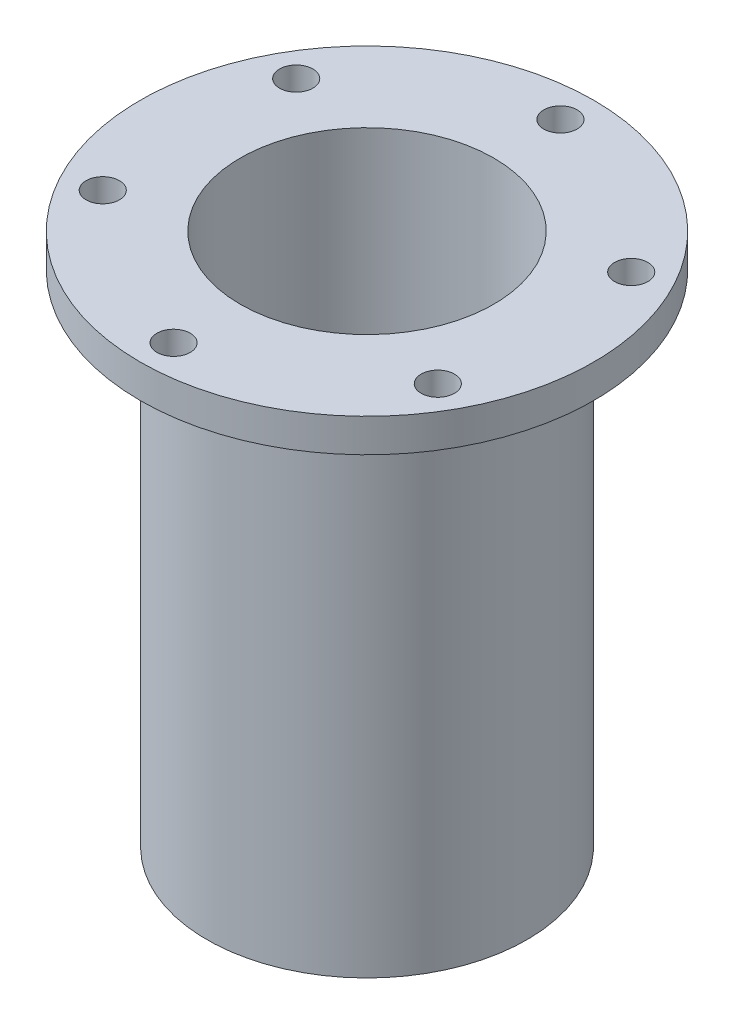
from build123d import *

# Parameters (mm, degrees)
SKETCH2_R          = 2.5
CUT_EXTRUDE1_DEPTH = 10


with BuildPart() as part:
    # Sketch1 → Revolve1 (revolve)
    with BuildSketch(Plane.XY, mode=Mode.PRIVATE) as revolve1_sk:
        Polygon((19, 0), (19, 80), (34, 80), (34, 75), (24, 75), (24, 0), align=None)
    revolve(revolve1_sk.sketch.rotate(Axis((0, 0, 0), (0, 1, 0)), 90), axis=Axis((0, 0, 0), (0, 1, 0)))

    # Sketch2 → Cut-Extrude1 (cut)
    with BuildSketch(Plane(origin=(0, 80, 0), x_dir=(1, 0, 0), z_dir=(0, 1, 0))):
        with Locations(Location((0, 29, 0), (0, 0, 270))):
            Circle(SKETCH2_R)
        with Locations(Location((25.11473671, 14.5, 0), (0, 0, 270))):
            Circle(SKETCH2_R)
        with Locations(Location((25.11473671, -14.5, 0), (0, 0, 270))):
            Circle(SKETCH2_R)
        with Locations(Location((0, -29, 0), (0, 0, 270))):
            Circle(SKETCH2_R)
        with Locations(Location((-25.11473671, -14.5, 0), (0, 0, 270))):
            Circle(SKETCH2_R)
        with Locations(Location((-25.11473671, 14.5, 0), (0, 0, 270))):
            Circle(SKETCH2_R)
    extrude(amount=-CUT_EXTRUDE1_DEPTH, mode=Mode.SUBTRACT)


solid = part.part
